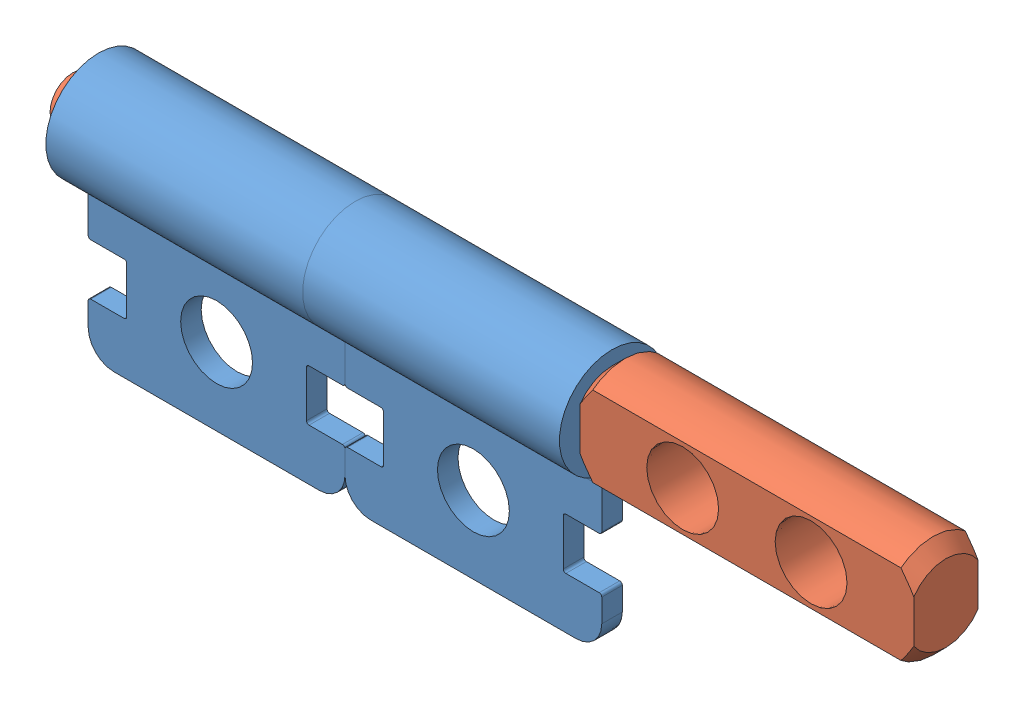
SolidWorks assembly ST060A1.SLDASM, configuration Default (file format 7000). Lengths in mm.
Overall size (34 10.05 4.1).
3 component instances, 2 part files, 6 mates.
Components (placement in the parent):
- ST030A Bracket-1: ST030A Bracket.SLDPRT [Default] at (-8.7526 2.7652 10.0581) size (10.06 10.05 4.1)
- ST030A Bracket-2: ST030A Bracket.SLDPRT [Default] at (1.2474 2.7652 10.0581) size (10.06 10.05 4.1)
- ST060A Shaft-1: ST060A Shaft.SLDPRT [ST080B0] at (24.2474 2.7652 10.0581) x (-1 0 0) z (0 0 1) size (34 4 2.5)
Mates (geometry in assembly coordinates):
- Coincident1: coincident anti-aligned: plane of ST030A Bracket-1 through (1.2474 0.3793 10.9581) normal (1 0 0); plane of ST030A Bracket-2 through (1.2474 0.3793 10.9581) normal (-1 0 0)
- Concentric1: concentric aligned: cylinder of ST030A Bracket-1 through (1.2474 2.7652 10.0581) axis (-1 0 0) radius 1.25; cylinder of ST030A Bracket-2 through (11.2474 2.7652 10.0581) axis (-1 0 0) radius 1.25
- Parallel1: parallel aligned: plane of ST030A Bracket-1 through (1.2474 0.3793 10.4581) normal (0 0 1); plane of ST030A Bracket-2 through (11.2474 0.3793 10.4581) normal (0 0 1)
- Coincident3: coincident anti-aligned: plane of ST030A Bracket-2 through (11.2474 0.3793 10.9581) normal (1 0 0); plane of ST060A Shaft-1 through (11.2474 1.2652 10.0581) normal (-1 0 0)
- Concentric2: concentric anti-aligned: cylinder of ST030A Bracket-1 through (1.2474 2.7652 10.0581) axis (-1 0 0) radius 1.25; cylinder of ST060A Shaft-1 through (-21.7526 2.7652 10.0581) axis (-1 0 0) radius 1.25
- Parallel2: parallel aligned: plane of ST030A Bracket-1 through (1.2474 0.3793 10.4581) normal (0 0 1); plane of ST060A Shaft-1 through (-2.7526 0.7652 11.3081) normal (0 0 1)
